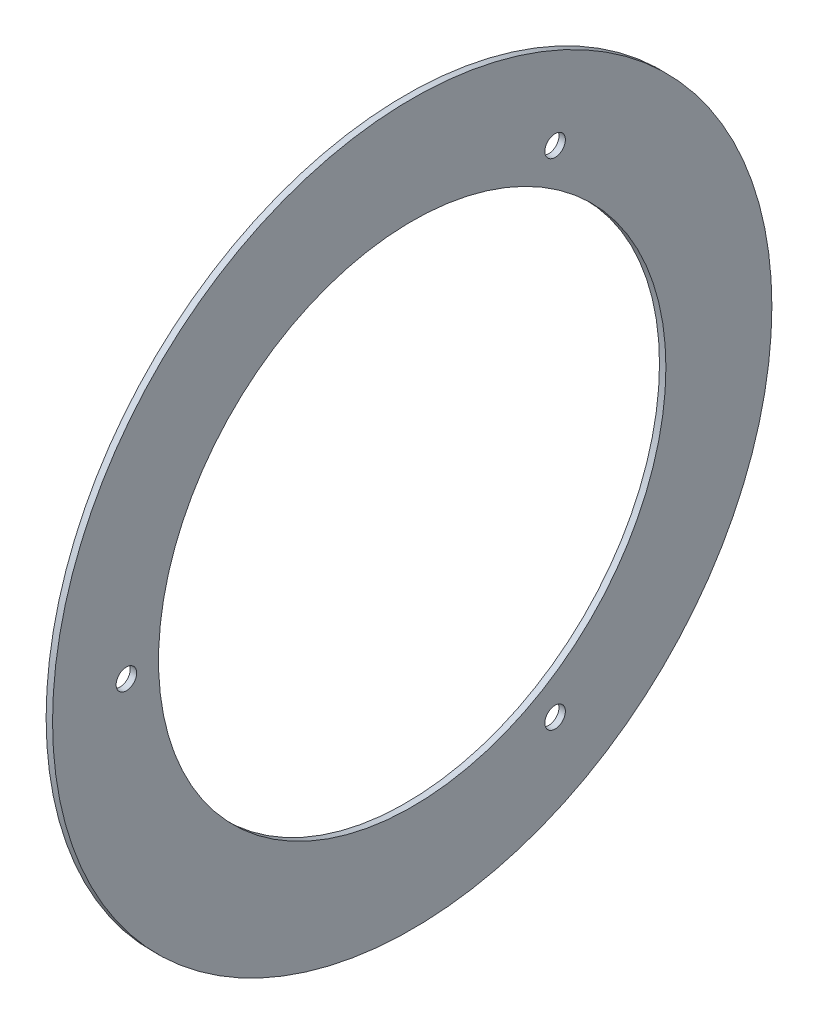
ISO-10303-21;
HEADER;
FILE_DESCRIPTION(('STEP AP214'),'2;1');
FILE_NAME('part.step','',(''),(''),'','','');
FILE_SCHEMA(('AUTOMOTIVE_DESIGN { 1 0 10303 214 1 1 1 1 }'));
ENDSEC;
DATA;
#1=APPLICATION_CONTEXT('core data for automotive mechanical design processes');
#2=APPLICATION_PROTOCOL_DEFINITION('international standard','automotive_design',2000,#1);
#3=PRODUCT_CONTEXT('',#1,'mechanical');
#4=PRODUCT('Part','Part','',(#3));
#5=PRODUCT_RELATED_PRODUCT_CATEGORY('part','',(#4));
#6=PRODUCT_DEFINITION_FORMATION('','',#4);
#7=PRODUCT_DEFINITION_CONTEXT('part definition',#1,'design');
#8=PRODUCT_DEFINITION('design','',#6,#7);
#9=PRODUCT_DEFINITION_SHAPE('','',#8);
#10=(LENGTH_UNIT() NAMED_UNIT(*) SI_UNIT(.MILLI.,.METRE.));
#11=(NAMED_UNIT(*) PLANE_ANGLE_UNIT() SI_UNIT($,.RADIAN.));
#12=(NAMED_UNIT(*) SI_UNIT($,.STERADIAN.) SOLID_ANGLE_UNIT());
#13=UNCERTAINTY_MEASURE_WITH_UNIT(LENGTH_MEASURE(1.E-05),#10,'distance_accuracy_value','');
#14=(GEOMETRIC_REPRESENTATION_CONTEXT(3) GLOBAL_UNCERTAINTY_ASSIGNED_CONTEXT((#13)) GLOBAL_UNIT_ASSIGNED_CONTEXT((#10,
#11,#12)) REPRESENTATION_CONTEXT('',''));
#15=CARTESIAN_POINT('',(0.,0.,0.));
#16=DIRECTION('',(0.,0.,1.));
#17=DIRECTION('',(1.,0.,0.));
#18=AXIS2_PLACEMENT_3D('',#15,#16,#17);
#19=CARTESIAN_POINT('',(1.,0.,0.));
#20=DIRECTION('',(1.,0.,0.));
#21=DIRECTION('',(0.,0.,-1.));
#22=AXIS2_PLACEMENT_3D('',#19,#20,#21);
#23=PLANE('',#22);
#24=CARTESIAN_POINT('',(1.,38.5381304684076,-22.2499999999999));
#25=DIRECTION('',(1.,0.,0.));
#26=DIRECTION('',(0.,0.,-1.));
#27=AXIS2_PLACEMENT_3D('',#24,#25,#26);
#28=CIRCLE('',#27,1.59999999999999);
#29=CARTESIAN_POINT('',(1.,38.5381304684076,-23.8499999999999));
#30=VERTEX_POINT('',#29);
#31=EDGE_CURVE('E63',#30,#30,#28,.T.);
#32=ORIENTED_EDGE('',*,*,#31,.F.);
#33=EDGE_LOOP('',(#32));
#34=FACE_BOUND('',#33,.T.);
#35=CARTESIAN_POINT('',(1.,0.,44.5));
#36=DIRECTION('',(1.,0.,0.));
#37=DIRECTION('',(0.,0.,-1.));
#38=AXIS2_PLACEMENT_3D('',#35,#36,#37);
#39=CIRCLE('',#38,1.59999999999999);
#40=CARTESIAN_POINT('',(1.,0.,42.9));
#41=VERTEX_POINT('',#40);
#42=EDGE_CURVE('E57',#41,#41,#39,.T.);
#43=ORIENTED_EDGE('',*,*,#42,.F.);
#44=EDGE_LOOP('',(#43));
#45=FACE_BOUND('',#44,.T.);
#46=CARTESIAN_POINT('',(1.,-38.5381304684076,-22.2499999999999));
#47=DIRECTION('',(1.,0.,0.));
#48=DIRECTION('',(0.,0.,-1.));
#49=AXIS2_PLACEMENT_3D('',#46,#47,#48);
#50=CIRCLE('',#49,1.59999999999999);
#51=CARTESIAN_POINT('',(1.,-38.5381304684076,-23.8499999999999));
#52=VERTEX_POINT('',#51);
#53=EDGE_CURVE('E51',#52,#52,#50,.T.);
#54=ORIENTED_EDGE('',*,*,#53,.F.);
#55=EDGE_LOOP('',(#54));
#56=FACE_BOUND('',#55,.T.);
#57=CARTESIAN_POINT('',(1.,0.,0.));
#58=DIRECTION('',(1.,0.,0.));
#59=DIRECTION('',(0.,0.,-1.));
#60=AXIS2_PLACEMENT_3D('',#57,#58,#59);
#61=CIRCLE('',#60,56.);
#62=CARTESIAN_POINT('',(1.,0.,-56.));
#63=VERTEX_POINT('',#62);
#64=EDGE_CURVE('E10',#63,#63,#61,.T.);
#65=ORIENTED_EDGE('',*,*,#64,.T.);
#66=EDGE_LOOP('',(#65));
#67=FACE_BOUND('',#66,.T.);
#68=CARTESIAN_POINT('',(1.,0.,0.));
#69=DIRECTION('',(1.,0.,0.));
#70=DIRECTION('',(0.,0.,-1.));
#71=AXIS2_PLACEMENT_3D('',#68,#69,#70);
#72=CIRCLE('',#71,39.5);
#73=CARTESIAN_POINT('',(1.,0.,-39.5));
#74=VERTEX_POINT('',#73);
#75=EDGE_CURVE('E41',#74,#74,#72,.T.);
#76=ORIENTED_EDGE('',*,*,#75,.F.);
#77=EDGE_LOOP('',(#76));
#78=FACE_BOUND('',#77,.T.);
#79=ADVANCED_FACE('F30',(#34,#45,#56,#67,#78),#23,.T.);
#80=CARTESIAN_POINT('',(0.,0.,0.));
#81=DIRECTION('',(1.,0.,0.));
#82=DIRECTION('',(0.,0.,-1.));
#83=AXIS2_PLACEMENT_3D('',#80,#81,#82);
#84=PLANE('',#83);
#85=CARTESIAN_POINT('',(0.,38.5381304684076,-22.2499999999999));
#86=DIRECTION('',(1.,0.,0.));
#87=DIRECTION('',(0.,0.,-1.));
#88=AXIS2_PLACEMENT_3D('',#85,#86,#87);
#89=CIRCLE('',#88,1.6);
#90=CARTESIAN_POINT('',(0.,38.5381304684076,-23.8499999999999));
#91=VERTEX_POINT('',#90);
#92=EDGE_CURVE('E60',#91,#91,#89,.T.);
#93=ORIENTED_EDGE('',*,*,#92,.T.);
#94=EDGE_LOOP('',(#93));
#95=FACE_BOUND('',#94,.T.);
#96=CARTESIAN_POINT('',(0.,0.,44.5));
#97=DIRECTION('',(1.,0.,0.));
#98=DIRECTION('',(0.,0.,-1.));
#99=AXIS2_PLACEMENT_3D('',#96,#97,#98);
#100=CIRCLE('',#99,1.6);
#101=CARTESIAN_POINT('',(0.,0.,42.9));
#102=VERTEX_POINT('',#101);
#103=EDGE_CURVE('E54',#102,#102,#100,.T.);
#104=ORIENTED_EDGE('',*,*,#103,.T.);
#105=EDGE_LOOP('',(#104));
#106=FACE_BOUND('',#105,.T.);
#107=CARTESIAN_POINT('',(0.,-38.5381304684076,-22.2499999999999));
#108=DIRECTION('',(1.,0.,0.));
#109=DIRECTION('',(0.,0.,-1.));
#110=AXIS2_PLACEMENT_3D('',#107,#108,#109);
#111=CIRCLE('',#110,1.6);
#112=CARTESIAN_POINT('',(0.,-38.5381304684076,-23.8499999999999));
#113=VERTEX_POINT('',#112);
#114=EDGE_CURVE('E46',#113,#113,#111,.T.);
#115=ORIENTED_EDGE('',*,*,#114,.T.);
#116=EDGE_LOOP('',(#115));
#117=FACE_BOUND('',#116,.T.);
#118=CARTESIAN_POINT('',(0.,0.,0.));
#119=DIRECTION('',(1.,0.,0.));
#120=DIRECTION('',(0.,0.,-1.));
#121=AXIS2_PLACEMENT_3D('',#118,#119,#120);
#122=CIRCLE('',#121,56.);
#123=CARTESIAN_POINT('',(0.,0.,-56.));
#124=VERTEX_POINT('',#123);
#125=EDGE_CURVE('E34',#124,#124,#122,.T.);
#126=ORIENTED_EDGE('',*,*,#125,.F.);
#127=EDGE_LOOP('',(#126));
#128=FACE_BOUND('',#127,.T.);
#129=CARTESIAN_POINT('',(0.,0.,0.));
#130=DIRECTION('',(1.,0.,0.));
#131=DIRECTION('',(0.,0.,-1.));
#132=AXIS2_PLACEMENT_3D('',#129,#130,#131);
#133=CIRCLE('',#132,39.5);
#134=CARTESIAN_POINT('',(0.,0.,-39.5));
#135=VERTEX_POINT('',#134);
#136=EDGE_CURVE('E43',#135,#135,#133,.T.);
#137=ORIENTED_EDGE('',*,*,#136,.T.);
#138=EDGE_LOOP('',(#137));
#139=FACE_BOUND('',#138,.T.);
#140=ADVANCED_FACE('F71',(#95,#106,#117,#128,#139),#84,.F.);
#141=CARTESIAN_POINT('',(1.,0.,0.));
#142=DIRECTION('',(-1.,0.,0.));
#143=DIRECTION('',(0.,0.,1.));
#144=AXIS2_PLACEMENT_3D('',#141,#142,#143);
#145=CYLINDRICAL_SURFACE('',#144,56.);
#146=ORIENTED_EDGE('',*,*,#64,.F.);
#147=EDGE_LOOP('',(#146));
#148=FACE_BOUND('',#147,.T.);
#149=ORIENTED_EDGE('',*,*,#125,.T.);
#150=EDGE_LOOP('',(#149));
#151=FACE_BOUND('',#150,.T.);
#152=ADVANCED_FACE('F32',(#148,#151),#145,.T.);
#153=CARTESIAN_POINT('',(1.,0.,0.));
#154=DIRECTION('',(-1.,0.,0.));
#155=DIRECTION('',(0.,0.,1.));
#156=AXIS2_PLACEMENT_3D('',#153,#154,#155);
#157=CYLINDRICAL_SURFACE('',#156,39.5);
#158=ORIENTED_EDGE('',*,*,#75,.T.);
#159=EDGE_LOOP('',(#158));
#160=FACE_BOUND('',#159,.T.);
#161=ORIENTED_EDGE('',*,*,#136,.F.);
#162=EDGE_LOOP('',(#161));
#163=FACE_BOUND('',#162,.T.);
#164=ADVANCED_FACE('F79',(#160,#163),#157,.F.);
#165=CARTESIAN_POINT('',(1.,-38.5381304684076,-22.2499999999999));
#166=DIRECTION('',(1.,0.,0.));
#167=DIRECTION('',(0.,0.,-1.));
#168=AXIS2_PLACEMENT_3D('',#165,#166,#167);
#169=CYLINDRICAL_SURFACE('',#168,1.59999999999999);
#170=ORIENTED_EDGE('',*,*,#114,.F.);
#171=EDGE_LOOP('',(#170));
#172=FACE_BOUND('',#171,.T.);
#173=ORIENTED_EDGE('',*,*,#53,.T.);
#174=EDGE_LOOP('',(#173));
#175=FACE_BOUND('',#174,.T.);
#176=ADVANCED_FACE('F82',(#172,#175),#169,.F.);
#177=CARTESIAN_POINT('',(1.,0.,44.5));
#178=DIRECTION('',(1.,0.,0.));
#179=DIRECTION('',(0.,0.,-1.));
#180=AXIS2_PLACEMENT_3D('',#177,#178,#179);
#181=CYLINDRICAL_SURFACE('',#180,1.59999999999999);
#182=ORIENTED_EDGE('',*,*,#103,.F.);
#183=EDGE_LOOP('',(#182));
#184=FACE_BOUND('',#183,.T.);
#185=ORIENTED_EDGE('',*,*,#42,.T.);
#186=EDGE_LOOP('',(#185));
#187=FACE_BOUND('',#186,.T.);
#188=ADVANCED_FACE('F96',(#184,#187),#181,.F.);
#189=CARTESIAN_POINT('',(1.,38.5381304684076,-22.2499999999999));
#190=DIRECTION('',(1.,0.,0.));
#191=DIRECTION('',(0.,0.,-1.));
#192=AXIS2_PLACEMENT_3D('',#189,#190,#191);
#193=CYLINDRICAL_SURFACE('',#192,1.59999999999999);
#194=ORIENTED_EDGE('',*,*,#92,.F.);
#195=EDGE_LOOP('',(#194));
#196=FACE_BOUND('',#195,.T.);
#197=ORIENTED_EDGE('',*,*,#31,.T.);
#198=EDGE_LOOP('',(#197));
#199=FACE_BOUND('',#198,.T.);
#200=ADVANCED_FACE('F67',(#196,#199),#193,.F.);
#201=CLOSED_SHELL('',(#79,#140,#152,#164,#176,#188,#200));
#202=MANIFOLD_SOLID_BREP('B2',#201);
#203=ADVANCED_BREP_SHAPE_REPRESENTATION('',(#18,#202),#14);
#204=SHAPE_DEFINITION_REPRESENTATION(#9,#203);
ENDSEC;
END-ISO-10303-21;
